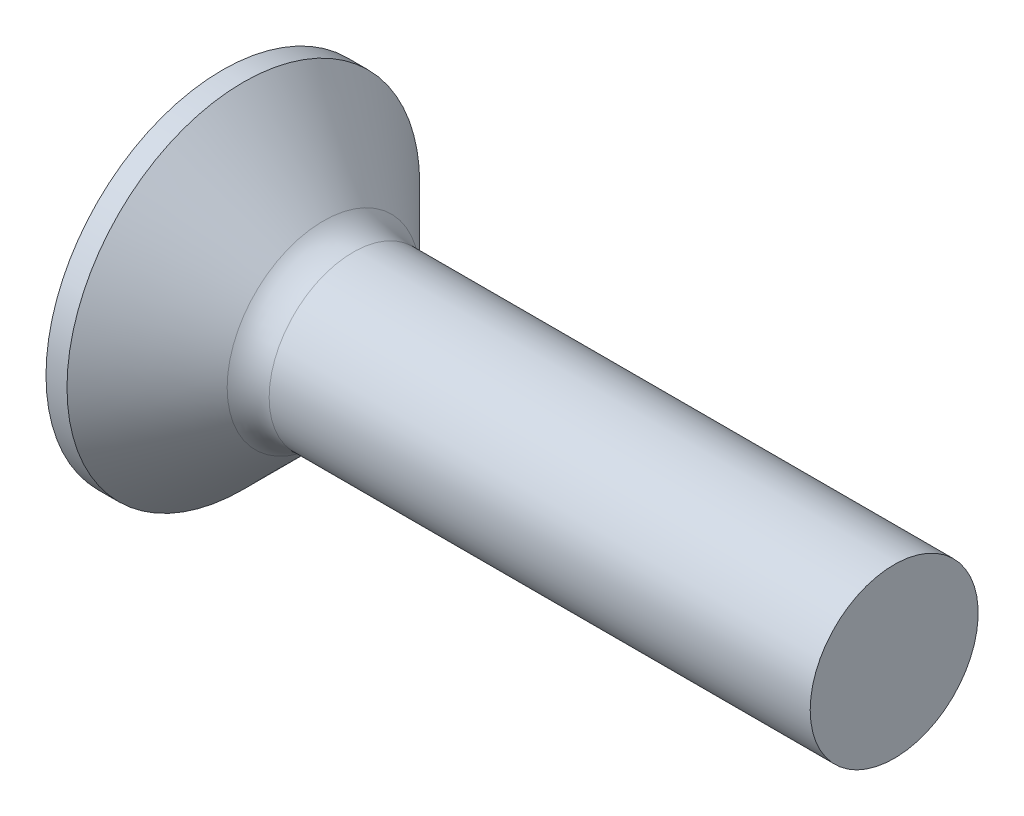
ISO-10303-21;
HEADER;
FILE_DESCRIPTION(('STEP AP214'),'2;1');
FILE_NAME('part.step','',(''),(''),'','','');
FILE_SCHEMA(('AUTOMOTIVE_DESIGN { 1 0 10303 214 1 1 1 1 }'));
ENDSEC;
DATA;
#1=APPLICATION_CONTEXT('core data for automotive mechanical design processes');
#2=APPLICATION_PROTOCOL_DEFINITION('international standard','automotive_design',2000,#1);
#3=PRODUCT_CONTEXT('',#1,'mechanical');
#4=PRODUCT('Part','Part','',(#3));
#5=PRODUCT_RELATED_PRODUCT_CATEGORY('part','',(#4));
#6=PRODUCT_DEFINITION_FORMATION('','',#4);
#7=PRODUCT_DEFINITION_CONTEXT('part definition',#1,'design');
#8=PRODUCT_DEFINITION('design','',#6,#7);
#9=PRODUCT_DEFINITION_SHAPE('','',#8);
#10=(LENGTH_UNIT() NAMED_UNIT(*) SI_UNIT(.MILLI.,.METRE.));
#11=(NAMED_UNIT(*) PLANE_ANGLE_UNIT() SI_UNIT($,.RADIAN.));
#12=(NAMED_UNIT(*) SI_UNIT($,.STERADIAN.) SOLID_ANGLE_UNIT());
#13=UNCERTAINTY_MEASURE_WITH_UNIT(LENGTH_MEASURE(1.E-05),#10,'distance_accuracy_value','');
#14=(GEOMETRIC_REPRESENTATION_CONTEXT(3) GLOBAL_UNCERTAINTY_ASSIGNED_CONTEXT((#13)) GLOBAL_UNIT_ASSIGNED_CONTEXT((#10,
#11,#12)) REPRESENTATION_CONTEXT('',''));
#15=CARTESIAN_POINT('',(0.,0.,0.));
#16=DIRECTION('',(0.,0.,1.));
#17=DIRECTION('',(1.,0.,0.));
#18=AXIS2_PLACEMENT_3D('',#15,#16,#17);
#19=CARTESIAN_POINT('',(0.,0.,0.));
#20=DIRECTION('',(-1.,0.,0.));
#21=DIRECTION('',(0.,0.,1.));
#22=AXIS2_PLACEMENT_3D('',#19,#20,#21);
#23=PLANE('',#22);
#24=CARTESIAN_POINT('',(0.,0.,0.));
#25=DIRECTION('',(-1.,0.,0.));
#26=DIRECTION('',(0.,0.,1.));
#27=AXIS2_PLACEMENT_3D('',#24,#25,#26);
#28=CIRCLE('',#27,4.2);
#29=CARTESIAN_POINT('',(0.,0.,4.2));
#30=VERTEX_POINT('',#29);
#31=EDGE_CURVE('E362',#30,#30,#28,.T.);
#32=ORIENTED_EDGE('',*,*,#31,.T.);
#33=EDGE_LOOP('',(#32));
#34=FACE_BOUND('',#33,.T.);
#35=DIRECTION('',(0.,0.,-1.));
#36=VECTOR('',#35,1.);
#37=CARTESIAN_POINT('',(0.,-0.515000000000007,2.2));
#38=LINE('',#37,#36);
#39=CARTESIAN_POINT('',(0.,-0.515000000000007,2.2));
#40=VERTEX_POINT('',#39);
#41=CARTESIAN_POINT('',(0.,-0.515000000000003,0.887981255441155));
#42=VERTEX_POINT('',#41);
#43=EDGE_CURVE('E300',#40,#42,#38,.T.);
#44=ORIENTED_EDGE('',*,*,#43,.T.);
#45=CARTESIAN_POINT('',(0.,0.,0.));
#46=DIRECTION('',(-1.,0.,0.));
#47=DIRECTION('',(0.,0.,1.));
#48=AXIS2_PLACEMENT_3D('',#45,#46,#47);
#49=CIRCLE('',#48,1.02651629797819);
#50=CARTESIAN_POINT('',(0.,-0.887981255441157,0.515));
#51=VERTEX_POINT('',#50);
#52=EDGE_CURVE('E391',#51,#42,#49,.T.);
#53=ORIENTED_EDGE('',*,*,#52,.F.);
#54=DIRECTION('',(0.,-1.,0.));
#55=VECTOR('',#54,1.);
#56=CARTESIAN_POINT('',(0.,2.2,0.515));
#57=LINE('',#56,#55);
#58=CARTESIAN_POINT('',(0.,-2.2,0.515));
#59=VERTEX_POINT('',#58);
#60=EDGE_CURVE('E326',#51,#59,#57,.T.);
#61=ORIENTED_EDGE('',*,*,#60,.T.);
#62=DIRECTION('',(0.,0.,-1.));
#63=VECTOR('',#62,1.);
#64=CARTESIAN_POINT('',(0.,-2.2,0.515));
#65=LINE('',#64,#63);
#66=CARTESIAN_POINT('',(0.,-2.2,-0.515));
#67=VERTEX_POINT('',#66);
#68=EDGE_CURVE('E331',#59,#67,#65,.T.);
#69=ORIENTED_EDGE('',*,*,#68,.T.);
#70=DIRECTION('',(0.,1.,0.));
#71=VECTOR('',#70,1.);
#72=CARTESIAN_POINT('',(0.,-2.2,-0.515));
#73=LINE('',#72,#71);
#74=CARTESIAN_POINT('',(0.,-0.887981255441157,-0.515));
#75=VERTEX_POINT('',#74);
#76=EDGE_CURVE('E327',#67,#75,#73,.T.);
#77=ORIENTED_EDGE('',*,*,#76,.T.);
#78=CARTESIAN_POINT('',(0.,-0.514999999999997,-0.887981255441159));
#79=VERTEX_POINT('',#78);
#80=EDGE_CURVE('E398',#79,#75,#49,.T.);
#81=ORIENTED_EDGE('',*,*,#80,.F.);
#82=CARTESIAN_POINT('',(0.,-0.514999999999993,-2.2));
#83=VERTEX_POINT('',#82);
#84=EDGE_CURVE('E298',#79,#83,#38,.T.);
#85=ORIENTED_EDGE('',*,*,#84,.T.);
#86=DIRECTION('',(0.,1.,0.));
#87=VECTOR('',#86,1.);
#88=CARTESIAN_POINT('',(0.,-0.514999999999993,-2.2));
#89=LINE('',#88,#87);
#90=CARTESIAN_POINT('',(0.,0.515000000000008,-2.2));
#91=VERTEX_POINT('',#90);
#92=EDGE_CURVE('E280',#83,#91,#89,.T.);
#93=ORIENTED_EDGE('',*,*,#92,.T.);
#94=DIRECTION('',(0.,0.,1.));
#95=VECTOR('',#94,1.);
#96=CARTESIAN_POINT('',(0.,0.515000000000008,-2.2));
#97=LINE('',#96,#95);
#98=CARTESIAN_POINT('',(0.,0.515000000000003,-0.887981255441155));
#99=VERTEX_POINT('',#98);
#100=EDGE_CURVE('E290',#91,#99,#97,.T.);
#101=ORIENTED_EDGE('',*,*,#100,.T.);
#102=CARTESIAN_POINT('',(0.,0.887981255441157,-0.515));
#103=VERTEX_POINT('',#102);
#104=EDGE_CURVE('E394',#103,#99,#49,.T.);
#105=ORIENTED_EDGE('',*,*,#104,.F.);
#106=CARTESIAN_POINT('',(0.,2.2,-0.515));
#107=VERTEX_POINT('',#106);
#108=EDGE_CURVE('E337',#103,#107,#73,.T.);
#109=ORIENTED_EDGE('',*,*,#108,.T.);
#110=DIRECTION('',(0.,0.,1.));
#111=VECTOR('',#110,1.);
#112=CARTESIAN_POINT('',(0.,2.2,-0.515));
#113=LINE('',#112,#111);
#114=CARTESIAN_POINT('',(0.,2.2,0.515));
#115=VERTEX_POINT('',#114);
#116=EDGE_CURVE('E323',#107,#115,#113,.T.);
#117=ORIENTED_EDGE('',*,*,#116,.T.);
#118=CARTESIAN_POINT('',(0.,0.887981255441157,0.515));
#119=VERTEX_POINT('',#118);
#120=EDGE_CURVE('E328',#115,#119,#57,.T.);
#121=ORIENTED_EDGE('',*,*,#120,.T.);
#122=CARTESIAN_POINT('',(0.,0.514999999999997,0.887981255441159));
#123=VERTEX_POINT('',#122);
#124=EDGE_CURVE('E393',#123,#119,#49,.T.);
#125=ORIENTED_EDGE('',*,*,#124,.F.);
#126=CARTESIAN_POINT('',(0.,0.514999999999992,2.2));
#127=VERTEX_POINT('',#126);
#128=EDGE_CURVE('E293',#123,#127,#97,.T.);
#129=ORIENTED_EDGE('',*,*,#128,.T.);
#130=DIRECTION('',(0.,-1.,0.));
#131=VECTOR('',#130,1.);
#132=CARTESIAN_POINT('',(0.,0.514999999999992,2.2));
#133=LINE('',#132,#131);
#134=EDGE_CURVE('E292',#127,#40,#133,.T.);
#135=ORIENTED_EDGE('',*,*,#134,.T.);
#136=EDGE_LOOP('',(#44,#53,#61,#69,#77,#81,#85,#93,#101,#105,#109,#117,#121,#125,#129,#135));
#137=FACE_BOUND('',#136,.T.);
#138=ADVANCED_FACE('F30',(#34,#137),#23,.T.);
#139=CARTESIAN_POINT('',(2.51,-0.948560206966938,0.515));
#140=DIRECTION('',(0.,0.,-1.));
#141=DIRECTION('',(0.,1.,0.));
#142=AXIS2_PLACEMENT_3D('',#139,#140,#141);
#143=PLANE('',#142);
#144=ORIENTED_EDGE('',*,*,#60,.F.);
#145=CARTESIAN_POINT('',(-1.54977564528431,-1.01130800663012,0.515));
#146=CARTESIAN_POINT('',(-1.23788517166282,-0.986826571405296,0.515));
#147=CARTESIAN_POINT('',(-0.926007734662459,-0.962176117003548,0.515));
#148=CARTESIAN_POINT('',(-0.302275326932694,-0.912414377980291,0.515));
#149=CARTESIAN_POINT('',(0.00957964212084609,-0.887303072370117,0.515));
#150=CARTESIAN_POINT('',(0.477326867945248,-0.849200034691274,0.515));
#151=CARTESIAN_POINT('',(0.63323687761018,-0.836426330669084,0.515));
#152=CARTESIAN_POINT('',(0.945041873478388,-0.810710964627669,0.515));
#153=CARTESIAN_POINT('',(1.10093685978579,-0.797769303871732,0.515));
#154=CARTESIAN_POINT('',(1.41270333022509,-0.771692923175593,0.515));
#155=CARTESIAN_POINT('',(1.56857481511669,-0.758558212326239,0.515));
#156=CARTESIAN_POINT('',(1.8803026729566,-0.732062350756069,0.515));
#157=CARTESIAN_POINT('',(2.03615904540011,-0.71870119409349,0.515));
#158=CARTESIAN_POINT('',(2.39015155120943,-0.688049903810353,0.515));
#159=CARTESIAN_POINT('',(2.58828059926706,-0.670677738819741,0.515));
#160=CARTESIAN_POINT('',(2.98448796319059,-0.635393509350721,0.515));
#161=CARTESIAN_POINT('',(3.18256627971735,-0.617481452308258,0.515));
#162=CARTESIAN_POINT('',(3.57863215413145,-0.580963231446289,0.515));
#163=CARTESIAN_POINT('',(3.77661972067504,-0.562357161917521,0.515));
#164=CARTESIAN_POINT('',(4.17251625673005,-0.524212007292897,0.515));
#165=CARTESIAN_POINT('',(4.37042522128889,-0.504672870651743,0.515));
#166=CARTESIAN_POINT('',(4.76621979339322,-0.464285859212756,0.515));
#167=CARTESIAN_POINT('',(4.96410533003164,-0.443437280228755,0.515));
#168=CARTESIAN_POINT('',(5.26075347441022,-0.410686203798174,0.515));
#169=CARTESIAN_POINT('',(5.35959766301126,-0.399523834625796,0.515));
#170=CARTESIAN_POINT('',(5.5572169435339,-0.376561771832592,0.515));
#171=CARTESIAN_POINT('',(5.65599203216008,-0.364762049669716,0.515));
#172=CARTESIAN_POINT('',(5.85350341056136,-0.340311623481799,0.515));
#173=CARTESIAN_POINT('',(5.95223963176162,-0.327660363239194,0.515));
#174=CARTESIAN_POINT('',(6.14954565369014,-0.301187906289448,0.515));
#175=CARTESIAN_POINT('',(6.24811547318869,-0.287366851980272,0.515));
#176=CARTESIAN_POINT('',(6.39580251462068,-0.265292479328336,0.515));
#177=CARTESIAN_POINT('',(6.44501926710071,-0.257707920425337,0.515));
#178=CARTESIAN_POINT('',(6.54335575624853,-0.241951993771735,0.515));
#179=CARTESIAN_POINT('',(6.5924754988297,-0.233780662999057,0.515));
#180=CARTESIAN_POINT('',(6.69060451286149,-0.216664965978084,0.515));
#181=CARTESIAN_POINT('',(6.73961372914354,-0.207720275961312,0.515));
#182=CARTESIAN_POINT('',(6.83741121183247,-0.188649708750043,0.515));
#183=CARTESIAN_POINT('',(6.88619942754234,-0.178523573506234,0.515));
#184=CARTESIAN_POINT('',(6.9348215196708,-0.167602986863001,0.515));
#185=B_SPLINE_CURVE_WITH_KNOTS('',3,(#145,#146,#147,#148,#149,#150,#151,#152,#153,#154,#155,
#156,#157,#158,#159,#160,#161,#162,#163,#164,#165,#166,#167,#168,#169,#170,#171,#172,#173,#174,
#175,#176,#177,#178,#179,#180,#181,#182,#183,#184),.UNSPECIFIED.,.F.,.F.,(4,2,2,2,2,2,2,2,2,2,2,
2,2,2,2,2,2,2,2,4),(0.,0.938549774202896,1.87714239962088,2.34643954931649,2.81573317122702,
3.2850047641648,3.75428868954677,4.35095567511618,4.9476144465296,5.54419244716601,
6.14080344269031,6.73773807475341,7.03615402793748,7.33458335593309,7.63320954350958,
7.93179943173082,8.08118979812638,8.23057075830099,8.38001456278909,8.52949106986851),.UNSPECIFIED.);
#186=CARTESIAN_POINT('',(2.51,-0.677477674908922,0.515));
#187=VERTEX_POINT('',#186);
#188=EDGE_CURVE('E406',#51,#187,#185,.T.);
#189=ORIENTED_EDGE('',*,*,#188,.T.);
#190=DIRECTION('',(0.,-1.,0.));
#191=VECTOR('',#190,1.);
#192=CARTESIAN_POINT('',(2.51,0.948560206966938,0.515));
#193=LINE('',#192,#191);
#194=CARTESIAN_POINT('',(2.51,-0.948560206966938,0.515));
#195=VERTEX_POINT('',#194);
#196=EDGE_CURVE('E351',#187,#195,#193,.T.);
#197=ORIENTED_EDGE('',*,*,#196,.T.);
#198=DIRECTION('',(0.89493436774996,0.446197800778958,0.));
#199=VECTOR('',#198,1.);
#200=CARTESIAN_POINT('',(0.,-2.2,0.515));
#201=LINE('',#200,#199);
#202=EDGE_CURVE('E338',#59,#195,#201,.T.);
#203=ORIENTED_EDGE('',*,*,#202,.F.);
#204=EDGE_LOOP('',(#144,#189,#197,#203));
#205=FACE_BOUND('',#204,.T.);
#206=ADVANCED_FACE('F162',(#205),#143,.T.);
#207=CARTESIAN_POINT('',(2.51,0.948560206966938,0.515));
#208=VERTEX_POINT('',#207);
#209=CARTESIAN_POINT('',(2.51,0.677477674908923,0.514999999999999));
#210=VERTEX_POINT('',#209);
#211=EDGE_CURVE('E352',#208,#210,#193,.T.);
#212=ORIENTED_EDGE('',*,*,#211,.T.);
#213=CARTESIAN_POINT('',(-1.54977564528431,1.01130800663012,0.515));
#214=CARTESIAN_POINT('',(-1.23788517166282,0.986826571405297,0.515));
#215=CARTESIAN_POINT('',(-0.926007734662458,0.962176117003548,0.515));
#216=CARTESIAN_POINT('',(-0.302275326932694,0.912414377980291,0.515));
#217=CARTESIAN_POINT('',(0.00957964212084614,0.887303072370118,0.515));
#218=CARTESIAN_POINT('',(0.477326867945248,0.849200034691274,0.515));
#219=CARTESIAN_POINT('',(0.63323687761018,0.836426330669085,0.515));
#220=CARTESIAN_POINT('',(0.945041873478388,0.810710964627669,0.515));
#221=CARTESIAN_POINT('',(1.10093685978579,0.797769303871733,0.515));
#222=CARTESIAN_POINT('',(1.41270333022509,0.771692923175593,0.515));
#223=CARTESIAN_POINT('',(1.56857481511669,0.758558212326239,0.515));
#224=CARTESIAN_POINT('',(1.8803026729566,0.732062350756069,0.515));
#225=CARTESIAN_POINT('',(2.03615904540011,0.71870119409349,0.515));
#226=CARTESIAN_POINT('',(2.39015155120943,0.688049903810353,0.515));
#227=CARTESIAN_POINT('',(2.58828059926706,0.670677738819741,0.515));
#228=CARTESIAN_POINT('',(2.98448796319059,0.635393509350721,0.515));
#229=CARTESIAN_POINT('',(3.18256627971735,0.617481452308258,0.515));
#230=CARTESIAN_POINT('',(3.57863215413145,0.580963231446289,0.515));
#231=CARTESIAN_POINT('',(3.77661972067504,0.562357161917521,0.515));
#232=CARTESIAN_POINT('',(4.17251625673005,0.524212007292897,0.515));
#233=CARTESIAN_POINT('',(4.37042522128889,0.504672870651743,0.515));
#234=CARTESIAN_POINT('',(4.76621979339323,0.464285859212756,0.515));
#235=CARTESIAN_POINT('',(4.96410533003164,0.443437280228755,0.515));
#236=CARTESIAN_POINT('',(5.26075347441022,0.410686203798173,0.515));
#237=CARTESIAN_POINT('',(5.35959766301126,0.399523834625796,0.515));
#238=CARTESIAN_POINT('',(5.55721694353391,0.376561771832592,0.515));
#239=CARTESIAN_POINT('',(5.65599203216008,0.364762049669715,0.515));
#240=CARTESIAN_POINT('',(5.85350341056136,0.340311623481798,0.515));
#241=CARTESIAN_POINT('',(5.95223963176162,0.327660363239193,0.515));
#242=CARTESIAN_POINT('',(6.14954565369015,0.301187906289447,0.515));
#243=CARTESIAN_POINT('',(6.24811547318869,0.287366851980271,0.515));
#244=CARTESIAN_POINT('',(6.39580251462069,0.265292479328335,0.515));
#245=CARTESIAN_POINT('',(6.44501926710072,0.257707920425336,0.515));
#246=CARTESIAN_POINT('',(6.54335575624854,0.241951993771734,0.515));
#247=CARTESIAN_POINT('',(6.59247549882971,0.233780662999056,0.515));
#248=CARTESIAN_POINT('',(6.6906045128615,0.216664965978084,0.515));
#249=CARTESIAN_POINT('',(6.73961372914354,0.207720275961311,0.515));
#250=CARTESIAN_POINT('',(6.83741121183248,0.188649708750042,0.515));
#251=CARTESIAN_POINT('',(6.88619942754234,0.178523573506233,0.515));
#252=CARTESIAN_POINT('',(6.9348215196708,0.167602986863,0.515));
#253=B_SPLINE_CURVE_WITH_KNOTS('',3,(#213,#214,#215,#216,#217,#218,#219,#220,#221,#222,#223,
#224,#225,#226,#227,#228,#229,#230,#231,#232,#233,#234,#235,#236,#237,#238,#239,#240,#241,#242,
#243,#244,#245,#246,#247,#248,#249,#250,#251,#252),.UNSPECIFIED.,.F.,.F.,(4,2,2,2,2,2,2,2,2,2,2,
2,2,2,2,2,2,2,2,4),(0.,0.938549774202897,1.87714239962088,2.34643954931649,2.81573317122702,
3.2850047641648,3.75428868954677,4.35095567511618,4.9476144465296,5.54419244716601,
6.14080344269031,6.73773807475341,7.03615402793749,7.33458335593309,7.63320954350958,
7.93179943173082,8.08118979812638,8.23057075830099,8.3800145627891,8.52949106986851),.UNSPECIFIED.);
#254=EDGE_CURVE('E222',#210,#119,#253,.F.);
#255=ORIENTED_EDGE('',*,*,#254,.T.);
#256=ORIENTED_EDGE('',*,*,#120,.F.);
#257=DIRECTION('',(0.89493436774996,-0.446197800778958,0.));
#258=VECTOR('',#257,1.);
#259=CARTESIAN_POINT('',(0.,2.2,0.515));
#260=LINE('',#259,#258);
#261=EDGE_CURVE('E58',#115,#208,#260,.T.);
#262=ORIENTED_EDGE('',*,*,#261,.T.);
#263=EDGE_LOOP('',(#212,#255,#256,#262));
#264=FACE_BOUND('',#263,.T.);
#265=ADVANCED_FACE('F167',(#264),#143,.T.);
#266=CARTESIAN_POINT('',(2.51,0.948560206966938,-0.515));
#267=DIRECTION('',(0.,0.,1.));
#268=DIRECTION('',(1.,0.,0.));
#269=AXIS2_PLACEMENT_3D('',#266,#267,#268);
#270=PLANE('',#269);
#271=DIRECTION('',(0.,1.,0.));
#272=VECTOR('',#271,1.);
#273=CARTESIAN_POINT('',(2.51,-0.948560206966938,-0.515));
#274=LINE('',#273,#272);
#275=CARTESIAN_POINT('',(2.51,-0.948560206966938,-0.515));
#276=VERTEX_POINT('',#275);
#277=CARTESIAN_POINT('',(2.51,-0.677477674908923,-0.514999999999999));
#278=VERTEX_POINT('',#277);
#279=EDGE_CURVE('E302',#276,#278,#274,.T.);
#280=ORIENTED_EDGE('',*,*,#279,.T.);
#281=CARTESIAN_POINT('',(-1.54977564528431,-1.01130800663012,-0.515));
#282=CARTESIAN_POINT('',(-1.23788517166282,-0.986826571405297,-0.515));
#283=CARTESIAN_POINT('',(-0.926007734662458,-0.962176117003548,-0.515));
#284=CARTESIAN_POINT('',(-0.302275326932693,-0.912414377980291,-0.515));
#285=CARTESIAN_POINT('',(0.00957964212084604,-0.887303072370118,-0.515));
#286=CARTESIAN_POINT('',(0.477326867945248,-0.849200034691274,-0.515));
#287=CARTESIAN_POINT('',(0.63323687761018,-0.836426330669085,-0.515));
#288=CARTESIAN_POINT('',(0.945041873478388,-0.810710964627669,-0.515));
#289=CARTESIAN_POINT('',(1.10093685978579,-0.797769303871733,-0.515));
#290=CARTESIAN_POINT('',(1.41270333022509,-0.771692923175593,-0.515));
#291=CARTESIAN_POINT('',(1.56857481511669,-0.758558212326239,-0.515));
#292=CARTESIAN_POINT('',(1.8803026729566,-0.732062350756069,-0.515));
#293=CARTESIAN_POINT('',(2.03615904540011,-0.71870119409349,-0.515));
#294=CARTESIAN_POINT('',(2.39015155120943,-0.688049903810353,-0.515));
#295=CARTESIAN_POINT('',(2.58828059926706,-0.670677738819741,-0.515));
#296=CARTESIAN_POINT('',(2.98448796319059,-0.635393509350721,-0.515));
#297=CARTESIAN_POINT('',(3.18256627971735,-0.617481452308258,-0.515));
#298=CARTESIAN_POINT('',(3.57863215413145,-0.580963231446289,-0.515));
#299=CARTESIAN_POINT('',(3.77661972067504,-0.562357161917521,-0.515));
#300=CARTESIAN_POINT('',(4.17251625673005,-0.524212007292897,-0.515));
#301=CARTESIAN_POINT('',(4.37042522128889,-0.504672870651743,-0.515));
#302=CARTESIAN_POINT('',(4.76621979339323,-0.464285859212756,-0.515));
#303=CARTESIAN_POINT('',(4.96410533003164,-0.443437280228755,-0.515));
#304=CARTESIAN_POINT('',(5.26075347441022,-0.410686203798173,-0.515));
#305=CARTESIAN_POINT('',(5.35959766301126,-0.399523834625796,-0.515));
#306=CARTESIAN_POINT('',(5.55721694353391,-0.376561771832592,-0.515));
#307=CARTESIAN_POINT('',(5.65599203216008,-0.364762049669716,-0.515));
#308=CARTESIAN_POINT('',(5.85350341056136,-0.340311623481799,-0.515));
#309=CARTESIAN_POINT('',(5.95223963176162,-0.327660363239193,-0.515));
#310=CARTESIAN_POINT('',(6.14954565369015,-0.301187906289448,-0.515));
#311=CARTESIAN_POINT('',(6.24811547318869,-0.287366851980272,-0.515));
#312=CARTESIAN_POINT('',(6.39580251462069,-0.265292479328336,-0.515));
#313=CARTESIAN_POINT('',(6.44501926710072,-0.257707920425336,-0.515));
#314=CARTESIAN_POINT('',(6.54335575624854,-0.241951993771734,-0.515));
#315=CARTESIAN_POINT('',(6.59247549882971,-0.233780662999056,-0.515));
#316=CARTESIAN_POINT('',(6.6906045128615,-0.216664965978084,-0.515));
#317=CARTESIAN_POINT('',(6.73961372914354,-0.207720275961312,-0.515));
#318=CARTESIAN_POINT('',(6.83741121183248,-0.188649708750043,-0.515));
#319=CARTESIAN_POINT('',(6.88619942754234,-0.178523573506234,-0.515));
#320=CARTESIAN_POINT('',(6.9348215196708,-0.167602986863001,-0.515));
#321=B_SPLINE_CURVE_WITH_KNOTS('',3,(#281,#282,#283,#284,#285,#286,#287,#288,#289,#290,#291,
#292,#293,#294,#295,#296,#297,#298,#299,#300,#301,#302,#303,#304,#305,#306,#307,#308,#309,#310,
#311,#312,#313,#314,#315,#316,#317,#318,#319,#320),.UNSPECIFIED.,.F.,.F.,(4,2,2,2,2,2,2,2,2,2,2,
2,2,2,2,2,2,2,2,4),(0.,0.938549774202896,1.87714239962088,2.34643954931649,2.81573317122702,
3.2850047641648,3.75428868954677,4.35095567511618,4.9476144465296,5.54419244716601,
6.14080344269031,6.73773807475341,7.03615402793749,7.33458335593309,7.63320954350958,
7.93179943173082,8.08118979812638,8.23057075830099,8.3800145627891,8.52949106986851),.UNSPECIFIED.);
#322=EDGE_CURVE('E216',#278,#75,#321,.F.);
#323=ORIENTED_EDGE('',*,*,#322,.T.);
#324=ORIENTED_EDGE('',*,*,#76,.F.);
#325=DIRECTION('',(0.89493436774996,0.446197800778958,0.));
#326=VECTOR('',#325,1.);
#327=CARTESIAN_POINT('',(0.,-2.2,-0.515));
#328=LINE('',#327,#326);
#329=EDGE_CURVE('E341',#67,#276,#328,.T.);
#330=ORIENTED_EDGE('',*,*,#329,.T.);
#331=EDGE_LOOP('',(#280,#323,#324,#330));
#332=FACE_BOUND('',#331,.T.);
#333=ADVANCED_FACE('F202',(#332),#270,.T.);
#334=ORIENTED_EDGE('',*,*,#108,.F.);
#335=CARTESIAN_POINT('',(-1.54977564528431,1.01130800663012,-0.515));
#336=CARTESIAN_POINT('',(-1.23788517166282,0.986826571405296,-0.515));
#337=CARTESIAN_POINT('',(-0.926007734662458,0.962176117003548,-0.515));
#338=CARTESIAN_POINT('',(-0.302275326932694,0.912414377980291,-0.515));
#339=CARTESIAN_POINT('',(0.00957964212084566,0.887303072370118,-0.515));
#340=CARTESIAN_POINT('',(0.477326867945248,0.849200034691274,-0.515));
#341=CARTESIAN_POINT('',(0.63323687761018,0.836426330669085,-0.515));
#342=CARTESIAN_POINT('',(0.945041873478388,0.810710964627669,-0.515));
#343=CARTESIAN_POINT('',(1.10093685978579,0.797769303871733,-0.515));
#344=CARTESIAN_POINT('',(1.41270333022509,0.771692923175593,-0.515));
#345=CARTESIAN_POINT('',(1.56857481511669,0.758558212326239,-0.515));
#346=CARTESIAN_POINT('',(1.8803026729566,0.732062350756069,-0.515));
#347=CARTESIAN_POINT('',(2.03615904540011,0.71870119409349,-0.515));
#348=CARTESIAN_POINT('',(2.39015155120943,0.688049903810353,-0.515));
#349=CARTESIAN_POINT('',(2.58828059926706,0.670677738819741,-0.515));
#350=CARTESIAN_POINT('',(2.98448796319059,0.635393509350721,-0.515));
#351=CARTESIAN_POINT('',(3.18256627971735,0.617481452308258,-0.515));
#352=CARTESIAN_POINT('',(3.57863215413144,0.580963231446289,-0.515));
#353=CARTESIAN_POINT('',(3.77661972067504,0.562357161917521,-0.515));
#354=CARTESIAN_POINT('',(4.17251625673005,0.524212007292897,-0.515));
#355=CARTESIAN_POINT('',(4.37042522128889,0.504672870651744,-0.515));
#356=CARTESIAN_POINT('',(4.76621979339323,0.464285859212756,-0.515));
#357=CARTESIAN_POINT('',(4.96410533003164,0.443437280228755,-0.515));
#358=CARTESIAN_POINT('',(5.26075347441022,0.410686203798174,-0.515));
#359=CARTESIAN_POINT('',(5.35959766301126,0.399523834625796,-0.515));
#360=CARTESIAN_POINT('',(5.5572169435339,0.376561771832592,-0.515));
#361=CARTESIAN_POINT('',(5.65599203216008,0.364762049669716,-0.515));
#362=CARTESIAN_POINT('',(5.85350341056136,0.340311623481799,-0.515));
#363=CARTESIAN_POINT('',(5.95223963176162,0.327660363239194,-0.515));
#364=CARTESIAN_POINT('',(6.14954565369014,0.301187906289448,-0.515));
#365=CARTESIAN_POINT('',(6.24811547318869,0.287366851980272,-0.515));
#366=CARTESIAN_POINT('',(6.39580251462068,0.265292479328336,-0.515));
#367=CARTESIAN_POINT('',(6.44501926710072,0.257707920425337,-0.515));
#368=CARTESIAN_POINT('',(6.54335575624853,0.241951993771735,-0.515));
#369=CARTESIAN_POINT('',(6.5924754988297,0.233780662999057,-0.515));
#370=CARTESIAN_POINT('',(6.69060451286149,0.216664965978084,-0.515));
#371=CARTESIAN_POINT('',(6.73961372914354,0.207720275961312,-0.515));
#372=CARTESIAN_POINT('',(6.83741121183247,0.188649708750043,-0.515));
#373=CARTESIAN_POINT('',(6.88619942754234,0.178523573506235,-0.515));
#374=CARTESIAN_POINT('',(6.9348215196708,0.167602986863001,-0.515));
#375=B_SPLINE_CURVE_WITH_KNOTS('',3,(#335,#336,#337,#338,#339,#340,#341,#342,#343,#344,#345,
#346,#347,#348,#349,#350,#351,#352,#353,#354,#355,#356,#357,#358,#359,#360,#361,#362,#363,#364,
#365,#366,#367,#368,#369,#370,#371,#372,#373,#374),.UNSPECIFIED.,.F.,.F.,(4,2,2,2,2,2,2,2,2,2,2,
2,2,2,2,2,2,2,2,4),(0.,0.938549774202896,1.87714239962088,2.34643954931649,2.81573317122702,
3.2850047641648,3.75428868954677,4.35095567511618,4.9476144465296,5.54419244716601,
6.14080344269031,6.73773807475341,7.03615402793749,7.33458335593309,7.63320954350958,
7.93179943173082,8.08118979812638,8.23057075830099,8.38001456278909,8.5294910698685),.UNSPECIFIED.);
#376=CARTESIAN_POINT('',(2.51,0.677477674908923,-0.514999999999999));
#377=VERTEX_POINT('',#376);
#378=EDGE_CURVE('E210',#103,#377,#375,.T.);
#379=ORIENTED_EDGE('',*,*,#378,.T.);
#380=CARTESIAN_POINT('',(2.51,0.948560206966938,-0.515));
#381=VERTEX_POINT('',#380);
#382=EDGE_CURVE('E299',#377,#381,#274,.T.);
#383=ORIENTED_EDGE('',*,*,#382,.T.);
#384=DIRECTION('',(0.89493436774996,-0.446197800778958,0.));
#385=VECTOR('',#384,1.);
#386=CARTESIAN_POINT('',(0.,2.2,-0.515));
#387=LINE('',#386,#385);
#388=EDGE_CURVE('E345',#107,#381,#387,.T.);
#389=ORIENTED_EDGE('',*,*,#388,.F.);
#390=EDGE_LOOP('',(#334,#379,#383,#389));
#391=FACE_BOUND('',#390,.T.);
#392=ADVANCED_FACE('F194',(#391),#270,.T.);
#393=CARTESIAN_POINT('',(2.51,0.948560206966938,-0.515));
#394=DIRECTION('',(1.,0.,0.));
#395=DIRECTION('',(0.,0.,-1.));
#396=AXIS2_PLACEMENT_3D('',#393,#394,#395);
#397=PLANE('',#396);
#398=CARTESIAN_POINT('',(2.51,0.,0.));
#399=DIRECTION('',(-1.,0.,0.));
#400=DIRECTION('',(0.,0.,1.));
#401=AXIS2_PLACEMENT_3D('',#398,#399,#400);
#402=CIRCLE('',#401,0.851);
#403=EDGE_CURVE('E382',#278,#187,#402,.T.);
#404=ORIENTED_EDGE('',*,*,#403,.F.);
#405=ORIENTED_EDGE('',*,*,#279,.F.);
#406=DIRECTION('',(0.,0.,-1.));
#407=VECTOR('',#406,1.);
#408=CARTESIAN_POINT('',(2.51,-0.948560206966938,0.515));
#409=LINE('',#408,#407);
#410=EDGE_CURVE('E348',#195,#276,#409,.T.);
#411=ORIENTED_EDGE('',*,*,#410,.F.);
#412=ORIENTED_EDGE('',*,*,#196,.F.);
#413=EDGE_LOOP('',(#404,#405,#411,#412));
#414=FACE_BOUND('',#413,.T.);
#415=ADVANCED_FACE('F190',(#414),#397,.F.);
#416=CARTESIAN_POINT('',(2.51,-0.515000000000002,0.67747767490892));
#417=VERTEX_POINT('',#416);
#418=CARTESIAN_POINT('',(2.51,0.514999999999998,0.677477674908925));
#419=VERTEX_POINT('',#418);
#420=EDGE_CURVE('E390',#417,#419,#402,.T.);
#421=ORIENTED_EDGE('',*,*,#420,.F.);
#422=DIRECTION('',(0.,0.,-1.));
#423=VECTOR('',#422,1.);
#424=CARTESIAN_POINT('',(2.51,-0.515000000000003,0.948560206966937));
#425=LINE('',#424,#423);
#426=CARTESIAN_POINT('',(2.51,-0.515000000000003,0.948560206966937));
#427=VERTEX_POINT('',#426);
#428=EDGE_CURVE('E317',#427,#417,#425,.T.);
#429=ORIENTED_EDGE('',*,*,#428,.F.);
#430=DIRECTION('',(0.,-1.,0.));
#431=VECTOR('',#430,1.);
#432=CARTESIAN_POINT('',(2.51,0.514999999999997,0.94856020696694));
#433=LINE('',#432,#431);
#434=CARTESIAN_POINT('',(2.51,0.514999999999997,0.94856020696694));
#435=VERTEX_POINT('',#434);
#436=EDGE_CURVE('E312',#435,#427,#433,.T.);
#437=ORIENTED_EDGE('',*,*,#436,.F.);
#438=DIRECTION('',(0.,0.,1.));
#439=VECTOR('',#438,1.);
#440=CARTESIAN_POINT('',(2.51,0.515000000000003,-0.948560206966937));
#441=LINE('',#440,#439);
#442=EDGE_CURVE('E322',#419,#435,#441,.T.);
#443=ORIENTED_EDGE('',*,*,#442,.F.);
#444=EDGE_LOOP('',(#421,#429,#437,#443));
#445=FACE_BOUND('',#444,.T.);
#446=ADVANCED_FACE('F193',(#445),#397,.F.);
#447=EDGE_CURVE('E392',#210,#377,#402,.T.);
#448=ORIENTED_EDGE('',*,*,#447,.F.);
#449=ORIENTED_EDGE('',*,*,#211,.F.);
#450=DIRECTION('',(0.,0.,1.));
#451=VECTOR('',#450,1.);
#452=CARTESIAN_POINT('',(2.51,0.948560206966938,-0.515));
#453=LINE('',#452,#451);
#454=EDGE_CURVE('E349',#381,#208,#453,.T.);
#455=ORIENTED_EDGE('',*,*,#454,.F.);
#456=ORIENTED_EDGE('',*,*,#382,.F.);
#457=EDGE_LOOP('',(#448,#449,#455,#456));
#458=FACE_BOUND('',#457,.T.);
#459=ADVANCED_FACE('F422',(#458),#397,.F.);
#460=CARTESIAN_POINT('',(2.51,0.515000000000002,-0.67747767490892));
#461=VERTEX_POINT('',#460);
#462=CARTESIAN_POINT('',(2.51,-0.514999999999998,-0.677477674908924));
#463=VERTEX_POINT('',#462);
#464=EDGE_CURVE('E389',#461,#463,#402,.T.);
#465=ORIENTED_EDGE('',*,*,#464,.F.);
#466=CARTESIAN_POINT('',(2.51,0.515000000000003,-0.948560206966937));
#467=VERTEX_POINT('',#466);
#468=EDGE_CURVE('E316',#467,#461,#441,.T.);
#469=ORIENTED_EDGE('',*,*,#468,.F.);
#470=DIRECTION('',(0.,1.,0.));
#471=VECTOR('',#470,1.);
#472=CARTESIAN_POINT('',(2.51,-0.514999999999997,-0.94856020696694));
#473=LINE('',#472,#471);
#474=CARTESIAN_POINT('',(2.51,-0.514999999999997,-0.94856020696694));
#475=VERTEX_POINT('',#474);
#476=EDGE_CURVE('E283',#475,#467,#473,.T.);
#477=ORIENTED_EDGE('',*,*,#476,.F.);
#478=EDGE_CURVE('E315',#463,#475,#425,.T.);
#479=ORIENTED_EDGE('',*,*,#478,.F.);
#480=EDGE_LOOP('',(#465,#469,#477,#479));
#481=FACE_BOUND('',#480,.T.);
#482=ADVANCED_FACE('F196',(#481),#397,.F.);
#483=CARTESIAN_POINT('',(2.51,0.514999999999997,0.94856020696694));
#484=DIRECTION('',(0.,-1.,0.));
#485=DIRECTION('',(1.,0.,0.));
#486=AXIS2_PLACEMENT_3D('',#483,#484,#485);
#487=PLANE('',#486);
#488=ORIENTED_EDGE('',*,*,#468,.T.);
#489=CARTESIAN_POINT('',(-1.54977564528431,0.515000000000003,-1.01130800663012));
#490=CARTESIAN_POINT('',(-1.23788517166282,0.515000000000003,-0.986826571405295));
#491=CARTESIAN_POINT('',(-0.926007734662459,0.515000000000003,-0.962176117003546));
#492=CARTESIAN_POINT('',(-0.302275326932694,0.515000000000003,-0.912414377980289));
#493=CARTESIAN_POINT('',(0.0095796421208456,0.515000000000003,-0.887303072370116));
#494=CARTESIAN_POINT('',(0.477326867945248,0.515000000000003,-0.849200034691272));
#495=CARTESIAN_POINT('',(0.633236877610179,0.515000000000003,-0.836426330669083));
#496=CARTESIAN_POINT('',(0.945041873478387,0.515000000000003,-0.810710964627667));
#497=CARTESIAN_POINT('',(1.10093685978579,0.515000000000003,-0.797769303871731));
#498=CARTESIAN_POINT('',(1.41270333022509,0.515000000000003,-0.771692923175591));
#499=CARTESIAN_POINT('',(1.56857481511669,0.515000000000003,-0.758558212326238));
#500=CARTESIAN_POINT('',(1.8803026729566,0.515000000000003,-0.732062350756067));
#501=CARTESIAN_POINT('',(2.03615904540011,0.515000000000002,-0.718701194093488));
#502=CARTESIAN_POINT('',(2.39015155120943,0.515000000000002,-0.688049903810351));
#503=CARTESIAN_POINT('',(2.58828059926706,0.515000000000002,-0.670677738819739));
#504=CARTESIAN_POINT('',(2.98448796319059,0.515000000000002,-0.63539350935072));
#505=CARTESIAN_POINT('',(3.18256627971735,0.515000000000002,-0.617481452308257));
#506=CARTESIAN_POINT('',(3.57863215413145,0.515000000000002,-0.580963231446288));
#507=CARTESIAN_POINT('',(3.77661972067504,0.515000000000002,-0.562357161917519));
#508=CARTESIAN_POINT('',(4.17251625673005,0.515000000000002,-0.524212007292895));
#509=CARTESIAN_POINT('',(4.37042522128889,0.515000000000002,-0.504672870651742));
#510=CARTESIAN_POINT('',(4.76621979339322,0.515000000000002,-0.464285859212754));
#511=CARTESIAN_POINT('',(4.96410533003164,0.515000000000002,-0.443437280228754));
#512=CARTESIAN_POINT('',(5.26075347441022,0.515000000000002,-0.410686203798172));
#513=CARTESIAN_POINT('',(5.35959766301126,0.515000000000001,-0.399523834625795));
#514=CARTESIAN_POINT('',(5.5572169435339,0.515000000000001,-0.376561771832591));
#515=CARTESIAN_POINT('',(5.65599203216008,0.515000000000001,-0.364762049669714));
#516=CARTESIAN_POINT('',(5.85350341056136,0.515000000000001,-0.340311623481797));
#517=CARTESIAN_POINT('',(5.95223963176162,0.515000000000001,-0.327660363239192));
#518=CARTESIAN_POINT('',(6.14954565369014,0.515000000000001,-0.301187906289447));
#519=CARTESIAN_POINT('',(6.24811547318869,0.515000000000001,-0.28736685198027));
#520=CARTESIAN_POINT('',(6.39580251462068,0.515000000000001,-0.265292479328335));
#521=CARTESIAN_POINT('',(6.44501926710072,0.515000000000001,-0.257707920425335));
#522=CARTESIAN_POINT('',(6.54335575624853,0.515000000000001,-0.241951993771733));
#523=CARTESIAN_POINT('',(6.5924754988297,0.515000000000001,-0.233780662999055));
#524=CARTESIAN_POINT('',(6.69060451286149,0.515000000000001,-0.216664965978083));
#525=CARTESIAN_POINT('',(6.73961372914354,0.515000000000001,-0.20772027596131));
#526=CARTESIAN_POINT('',(6.83741121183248,0.515000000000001,-0.188649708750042));
#527=CARTESIAN_POINT('',(6.88619942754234,0.515000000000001,-0.178523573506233));
#528=CARTESIAN_POINT('',(6.9348215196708,0.515000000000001,-0.167602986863));
#529=B_SPLINE_CURVE_WITH_KNOTS('',3,(#489,#490,#491,#492,#493,#494,#495,#496,#497,#498,#499,
#500,#501,#502,#503,#504,#505,#506,#507,#508,#509,#510,#511,#512,#513,#514,#515,#516,#517,#518,
#519,#520,#521,#522,#523,#524,#525,#526,#527,#528),.UNSPECIFIED.,.F.,.F.,(4,2,2,2,2,2,2,2,2,2,2,
2,2,2,2,2,2,2,2,4),(0.,0.938549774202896,1.87714239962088,2.34643954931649,2.81573317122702,
3.2850047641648,3.75428868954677,4.35095567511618,4.9476144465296,5.54419244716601,
6.14080344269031,6.73773807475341,7.03615402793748,7.33458335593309,7.63320954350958,
7.93179943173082,8.08118979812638,8.23057075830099,8.38001456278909,8.52949106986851),.UNSPECIFIED.);
#530=EDGE_CURVE('E247',#461,#99,#529,.F.);
#531=ORIENTED_EDGE('',*,*,#530,.T.);
#532=ORIENTED_EDGE('',*,*,#100,.F.);
#533=DIRECTION('',(0.89493436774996,0.,0.446197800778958));
#534=VECTOR('',#533,1.);
#535=CARTESIAN_POINT('',(0.,0.515000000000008,-2.2));
#536=LINE('',#535,#534);
#537=EDGE_CURVE('E276',#91,#467,#536,.T.);
#538=ORIENTED_EDGE('',*,*,#537,.T.);
#539=EDGE_LOOP('',(#488,#531,#532,#538));
#540=FACE_BOUND('',#539,.T.);
#541=ADVANCED_FACE('F253',(#540),#487,.T.);
#542=CARTESIAN_POINT('',(2.51,-0.514999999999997,-0.94856020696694));
#543=DIRECTION('',(0.,1.,0.));
#544=DIRECTION('',(0.,0.,1.));
#545=AXIS2_PLACEMENT_3D('',#542,#543,#544);
#546=PLANE('',#545);
#547=ORIENTED_EDGE('',*,*,#84,.F.);
#548=CARTESIAN_POINT('',(-1.54977564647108,-0.514999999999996,-1.01130800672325));
#549=CARTESIAN_POINT('',(-1.23788517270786,-0.514999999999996,-0.986826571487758));
#550=CARTESIAN_POINT('',(-0.926007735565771,-0.514999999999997,-0.962176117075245));
#551=CARTESIAN_POINT('',(-0.302275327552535,-0.514999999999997,-0.912414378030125));
#552=CARTESIAN_POINT('',(0.00957964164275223,-0.514999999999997,-0.887303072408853));
#553=CARTESIAN_POINT('',(0.477326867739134,-0.514999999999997,-0.849200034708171));
#554=CARTESIAN_POINT('',(0.633236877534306,-0.514999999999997,-0.836426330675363));
#555=CARTESIAN_POINT('',(0.945041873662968,-0.514999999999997,-0.810710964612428));
#556=CARTESIAN_POINT('',(1.10093686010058,-0.514999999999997,-0.797769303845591));
#557=CARTESIAN_POINT('',(1.41270333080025,-0.514999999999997,-0.771692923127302));
#558=CARTESIAN_POINT('',(1.56857481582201,-0.514999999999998,-0.758558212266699));
#559=CARTESIAN_POINT('',(1.8803026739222,-0.514999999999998,-0.73206235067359));
#560=CARTESIAN_POINT('',(2.03615904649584,-0.514999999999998,-0.718701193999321));
#561=CARTESIAN_POINT('',(2.39015155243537,-0.514999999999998,-0.688049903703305));
#562=CARTESIAN_POINT('',(2.58828060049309,-0.514999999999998,-0.670677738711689));
#563=CARTESIAN_POINT('',(2.98448796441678,-0.514999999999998,-0.635393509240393));
#564=CARTESIAN_POINT('',(3.18256628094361,-0.514999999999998,-0.617481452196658));
#565=CARTESIAN_POINT('',(3.57863215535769,-0.514999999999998,-0.580963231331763));
#566=CARTESIAN_POINT('',(3.77661972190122,-0.514999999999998,-0.562357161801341));
#567=CARTESIAN_POINT('',(4.17251625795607,-0.514999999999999,-0.524212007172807));
#568=CARTESIAN_POINT('',(4.37042522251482,-0.514999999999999,-0.504672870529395));
#569=CARTESIAN_POINT('',(4.76621979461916,-0.514999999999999,-0.464285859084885));
#570=CARTESIAN_POINT('',(4.96410533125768,-0.514999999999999,-0.443437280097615));
#571=CARTESIAN_POINT('',(5.26075347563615,-0.514999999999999,-0.410686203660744));
#572=CARTESIAN_POINT('',(5.35959766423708,-0.514999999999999,-0.399523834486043));
#573=CARTESIAN_POINT('',(5.55721694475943,-0.514999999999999,-0.376561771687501));
#574=CARTESIAN_POINT('',(5.65599203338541,-0.514999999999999,-0.36476204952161));
#575=CARTESIAN_POINT('',(5.8535034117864,-0.514999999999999,-0.340311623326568));
#576=CARTESIAN_POINT('',(5.95223963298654,-0.514999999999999,-0.32766036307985));
#577=CARTESIAN_POINT('',(6.14954565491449,-0.514999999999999,-0.30118790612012));
#578=CARTESIAN_POINT('',(6.24811547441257,-0.514999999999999,-0.287366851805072));
#579=CARTESIAN_POINT('',(6.39580251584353,-0.514999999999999,-0.265292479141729));
#580=CARTESIAN_POINT('',(6.44501926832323,-0.515,-0.257707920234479));
#581=CARTESIAN_POINT('',(6.54335575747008,-0.515,-0.241951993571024));
#582=CARTESIAN_POINT('',(6.59247550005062,-0.515,-0.233780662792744));
#583=CARTESIAN_POINT('',(6.69060451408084,-0.515,-0.21666496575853));
#584=CARTESIAN_POINT('',(6.73961373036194,-0.515,-0.207720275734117));
#585=CARTESIAN_POINT('',(6.83741121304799,-0.515,-0.188649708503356));
#586=CARTESIAN_POINT('',(6.88619942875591,-0.515,-0.178523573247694));
#587=CARTESIAN_POINT('',(6.93482152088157,-0.515,-0.167602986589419));
#588=B_SPLINE_CURVE_WITH_KNOTS('',3,(#548,#549,#550,#551,#552,#553,#554,#555,#556,#557,#558,
#559,#560,#561,#562,#563,#564,#565,#566,#567,#568,#569,#570,#571,#572,#573,#574,#575,#576,#577,
#578,#579,#580,#581,#582,#583,#584,#585,#586,#587),.UNSPECIFIED.,.F.,.F.,(4,2,2,2,2,2,2,2,2,2,2,
2,2,2,2,2,2,2,2,4),(0.,0.93854977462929,1.87714240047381,2.34643955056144,2.81573317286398,
3.28500476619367,3.75428869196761,4.35095567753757,4.94761444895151,5.54419244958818,
6.14080344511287,6.73773807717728,7.0361540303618,7.33458335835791,7.63320954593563,
7.93179943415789,8.0811898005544,8.23057076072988,8.38001456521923,8.52949107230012),.UNSPECIFIED.);
#589=EDGE_CURVE('E242',#79,#463,#588,.T.);
#590=ORIENTED_EDGE('',*,*,#589,.T.);
#591=ORIENTED_EDGE('',*,*,#478,.T.);
#592=DIRECTION('',(0.89493436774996,0.,0.446197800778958));
#593=VECTOR('',#592,1.);
#594=CARTESIAN_POINT('',(0.,-0.514999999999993,-2.2));
#595=LINE('',#594,#593);
#596=EDGE_CURVE('E286',#83,#475,#595,.T.);
#597=ORIENTED_EDGE('',*,*,#596,.F.);
#598=EDGE_LOOP('',(#547,#590,#591,#597));
#599=FACE_BOUND('',#598,.T.);
#600=ADVANCED_FACE('F257',(#599),#546,.T.);
#601=ORIENTED_EDGE('',*,*,#428,.T.);
#602=CARTESIAN_POINT('',(-1.54977564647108,-0.515000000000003,1.01130800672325));
#603=CARTESIAN_POINT('',(-1.23788517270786,-0.515000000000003,0.986826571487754));
#604=CARTESIAN_POINT('',(-0.926007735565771,-0.515000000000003,0.962176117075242));
#605=CARTESIAN_POINT('',(-0.302275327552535,-0.515000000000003,0.912414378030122));
#606=CARTESIAN_POINT('',(0.00957964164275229,-0.515000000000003,0.887303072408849));
#607=CARTESIAN_POINT('',(0.477326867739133,-0.515000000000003,0.849200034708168));
#608=CARTESIAN_POINT('',(0.633236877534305,-0.515000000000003,0.83642633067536));
#609=CARTESIAN_POINT('',(0.945041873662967,-0.515000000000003,0.810710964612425));
#610=CARTESIAN_POINT('',(1.10093686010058,-0.515000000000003,0.797769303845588));
#611=CARTESIAN_POINT('',(1.41270333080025,-0.515000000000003,0.771692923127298));
#612=CARTESIAN_POINT('',(1.568574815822,-0.515000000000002,0.758558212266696));
#613=CARTESIAN_POINT('',(1.8803026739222,-0.515000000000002,0.732062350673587));
#614=CARTESIAN_POINT('',(2.03615904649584,-0.515000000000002,0.718701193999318));
#615=CARTESIAN_POINT('',(2.39015155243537,-0.515000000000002,0.688049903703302));
#616=CARTESIAN_POINT('',(2.58828060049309,-0.515000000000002,0.670677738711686));
#617=CARTESIAN_POINT('',(2.98448796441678,-0.515000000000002,0.635393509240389));
#618=CARTESIAN_POINT('',(3.18256628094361,-0.515000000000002,0.617481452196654));
#619=CARTESIAN_POINT('',(3.57863215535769,-0.515000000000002,0.58096323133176));
#620=CARTESIAN_POINT('',(3.77661972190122,-0.515000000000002,0.562357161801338));
#621=CARTESIAN_POINT('',(4.17251625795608,-0.515000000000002,0.524212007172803));
#622=CARTESIAN_POINT('',(4.37042522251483,-0.515000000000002,0.504672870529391));
#623=CARTESIAN_POINT('',(4.76621979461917,-0.515000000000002,0.464285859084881));
#624=CARTESIAN_POINT('',(4.96410533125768,-0.515000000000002,0.443437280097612));
#625=CARTESIAN_POINT('',(5.26075347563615,-0.515000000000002,0.41068620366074));
#626=CARTESIAN_POINT('',(5.35959766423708,-0.515000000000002,0.39952383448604));
#627=CARTESIAN_POINT('',(5.55721694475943,-0.515000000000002,0.376561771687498));
#628=CARTESIAN_POINT('',(5.65599203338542,-0.515000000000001,0.364762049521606));
#629=CARTESIAN_POINT('',(5.8535034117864,-0.515000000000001,0.340311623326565));
#630=CARTESIAN_POINT('',(5.95223963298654,-0.515000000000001,0.327660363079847));
#631=CARTESIAN_POINT('',(6.14954565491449,-0.515000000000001,0.301187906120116));
#632=CARTESIAN_POINT('',(6.24811547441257,-0.515000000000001,0.287366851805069));
#633=CARTESIAN_POINT('',(6.39580251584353,-0.515000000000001,0.265292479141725));
#634=CARTESIAN_POINT('',(6.44501926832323,-0.515000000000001,0.257707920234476));
#635=CARTESIAN_POINT('',(6.54335575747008,-0.515000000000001,0.241951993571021));
#636=CARTESIAN_POINT('',(6.59247550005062,-0.515000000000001,0.23378066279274));
#637=CARTESIAN_POINT('',(6.69060451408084,-0.515000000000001,0.216664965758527));
#638=CARTESIAN_POINT('',(6.73961373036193,-0.515000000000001,0.207720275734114));
#639=CARTESIAN_POINT('',(6.83741121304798,-0.515000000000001,0.188649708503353));
#640=CARTESIAN_POINT('',(6.88619942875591,-0.515000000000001,0.178523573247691));
#641=CARTESIAN_POINT('',(6.93482152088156,-0.515000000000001,0.167602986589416));
#642=B_SPLINE_CURVE_WITH_KNOTS('',3,(#602,#603,#604,#605,#606,#607,#608,#609,#610,#611,#612,
#613,#614,#615,#616,#617,#618,#619,#620,#621,#622,#623,#624,#625,#626,#627,#628,#629,#630,#631,
#632,#633,#634,#635,#636,#637,#638,#639,#640,#641),.UNSPECIFIED.,.F.,.F.,(4,2,2,2,2,2,2,2,2,2,2,
2,2,2,2,2,2,2,2,4),(0.,0.93854977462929,1.87714240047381,2.34643955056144,2.81573317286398,
3.28500476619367,3.75428869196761,4.35095567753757,4.94761444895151,5.54419244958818,
6.14080344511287,6.73773807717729,7.0361540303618,7.33458335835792,7.63320954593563,
7.93179943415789,8.0811898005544,8.23057076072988,8.38001456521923,8.52949107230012),.UNSPECIFIED.);
#643=EDGE_CURVE('E235',#417,#42,#642,.F.);
#644=ORIENTED_EDGE('',*,*,#643,.T.);
#645=ORIENTED_EDGE('',*,*,#43,.F.);
#646=DIRECTION('',(0.89493436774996,0.,-0.446197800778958));
#647=VECTOR('',#646,1.);
#648=CARTESIAN_POINT('',(0.,-0.515000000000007,2.2));
#649=LINE('',#648,#647);
#650=EDGE_CURVE('E287',#40,#427,#649,.T.);
#651=ORIENTED_EDGE('',*,*,#650,.T.);
#652=EDGE_LOOP('',(#601,#644,#645,#651));
#653=FACE_BOUND('',#652,.T.);
#654=ADVANCED_FACE('F444',(#653),#546,.T.);
#655=ORIENTED_EDGE('',*,*,#128,.F.);
#656=CARTESIAN_POINT('',(-1.54977564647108,0.514999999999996,1.01130800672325));
#657=CARTESIAN_POINT('',(-1.23788517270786,0.514999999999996,0.986826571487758));
#658=CARTESIAN_POINT('',(-0.926007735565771,0.514999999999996,0.962176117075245));
#659=CARTESIAN_POINT('',(-0.302275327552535,0.514999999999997,0.912414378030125));
#660=CARTESIAN_POINT('',(0.00957964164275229,0.514999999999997,0.887303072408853));
#661=CARTESIAN_POINT('',(0.477326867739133,0.514999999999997,0.849200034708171));
#662=CARTESIAN_POINT('',(0.633236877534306,0.514999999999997,0.836426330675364));
#663=CARTESIAN_POINT('',(0.945041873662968,0.514999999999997,0.810710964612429));
#664=CARTESIAN_POINT('',(1.10093686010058,0.514999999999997,0.797769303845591));
#665=CARTESIAN_POINT('',(1.41270333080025,0.514999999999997,0.771692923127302));
#666=CARTESIAN_POINT('',(1.56857481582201,0.514999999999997,0.7585582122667));
#667=CARTESIAN_POINT('',(1.8803026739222,0.514999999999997,0.732062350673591));
#668=CARTESIAN_POINT('',(2.03615904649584,0.514999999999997,0.718701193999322));
#669=CARTESIAN_POINT('',(2.39015155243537,0.514999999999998,0.688049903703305));
#670=CARTESIAN_POINT('',(2.5882806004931,0.514999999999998,0.670677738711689));
#671=CARTESIAN_POINT('',(2.98448796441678,0.514999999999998,0.635393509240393));
#672=CARTESIAN_POINT('',(3.18256628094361,0.514999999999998,0.617481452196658));
#673=CARTESIAN_POINT('',(3.57863215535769,0.514999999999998,0.580963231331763));
#674=CARTESIAN_POINT('',(3.77661972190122,0.514999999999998,0.562357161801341));
#675=CARTESIAN_POINT('',(4.17251625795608,0.514999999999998,0.524212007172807));
#676=CARTESIAN_POINT('',(4.37042522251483,0.514999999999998,0.504672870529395));
#677=CARTESIAN_POINT('',(4.76621979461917,0.514999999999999,0.464285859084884));
#678=CARTESIAN_POINT('',(4.96410533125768,0.514999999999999,0.443437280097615));
#679=CARTESIAN_POINT('',(5.26075347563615,0.514999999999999,0.410686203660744));
#680=CARTESIAN_POINT('',(5.35959766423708,0.514999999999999,0.399523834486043));
#681=CARTESIAN_POINT('',(5.55721694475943,0.514999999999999,0.376561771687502));
#682=CARTESIAN_POINT('',(5.65599203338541,0.514999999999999,0.36476204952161));
#683=CARTESIAN_POINT('',(5.8535034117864,0.514999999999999,0.340311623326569));
#684=CARTESIAN_POINT('',(5.95223963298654,0.514999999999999,0.32766036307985));
#685=CARTESIAN_POINT('',(6.14954565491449,0.514999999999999,0.30118790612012));
#686=CARTESIAN_POINT('',(6.24811547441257,0.514999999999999,0.287366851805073));
#687=CARTESIAN_POINT('',(6.39580251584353,0.514999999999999,0.26529247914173));
#688=CARTESIAN_POINT('',(6.44501926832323,0.514999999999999,0.25770792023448));
#689=CARTESIAN_POINT('',(6.54335575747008,0.514999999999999,0.241951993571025));
#690=CARTESIAN_POINT('',(6.59247550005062,0.514999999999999,0.233780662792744));
#691=CARTESIAN_POINT('',(6.69060451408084,0.514999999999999,0.216664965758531));
#692=CARTESIAN_POINT('',(6.73961373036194,0.514999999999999,0.207720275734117));
#693=CARTESIAN_POINT('',(6.83741121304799,0.514999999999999,0.188649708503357));
#694=CARTESIAN_POINT('',(6.88619942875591,0.515,0.178523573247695));
#695=CARTESIAN_POINT('',(6.93482152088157,0.515,0.16760298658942));
#696=B_SPLINE_CURVE_WITH_KNOTS('',3,(#656,#657,#658,#659,#660,#661,#662,#663,#664,#665,#666,
#667,#668,#669,#670,#671,#672,#673,#674,#675,#676,#677,#678,#679,#680,#681,#682,#683,#684,#685,
#686,#687,#688,#689,#690,#691,#692,#693,#694,#695),.UNSPECIFIED.,.F.,.F.,(4,2,2,2,2,2,2,2,2,2,2,
2,2,2,2,2,2,2,2,4),(0.,0.93854977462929,1.87714240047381,2.34643955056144,2.81573317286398,
3.28500476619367,3.75428869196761,4.35095567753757,4.94761444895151,5.54419244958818,
6.14080344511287,6.73773807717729,7.0361540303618,7.33458335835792,7.63320954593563,
7.93179943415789,8.0811898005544,8.23057076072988,8.38001456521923,8.52949107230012),.UNSPECIFIED.);
#697=EDGE_CURVE('E11',#123,#419,#696,.T.);
#698=ORIENTED_EDGE('',*,*,#697,.T.);
#699=ORIENTED_EDGE('',*,*,#442,.T.);
#700=DIRECTION('',(0.89493436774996,0.,-0.446197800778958));
#701=VECTOR('',#700,1.);
#702=CARTESIAN_POINT('',(0.,0.514999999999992,2.2));
#703=LINE('',#702,#701);
#704=EDGE_CURVE('E309',#127,#435,#703,.T.);
#705=ORIENTED_EDGE('',*,*,#704,.F.);
#706=EDGE_LOOP('',(#655,#698,#699,#705));
#707=FACE_BOUND('',#706,.T.);
#708=ADVANCED_FACE('F177',(#707),#487,.T.);
#709=CARTESIAN_POINT('',(-6.34999999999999,0.,0.));
#710=DIRECTION('',(-1.,0.,0.));
#711=DIRECTION('',(0.,0.,1.));
#712=AXIS2_PLACEMENT_3D('',#709,#710,#711);
#713=CYLINDRICAL_SURFACE('',#712,4.2);
#714=CARTESIAN_POINT('',(0.500000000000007,0.,0.));
#715=DIRECTION('',(-1.,0.,0.));
#716=DIRECTION('',(0.,0.,1.));
#717=AXIS2_PLACEMENT_3D('',#714,#715,#716);
#718=CIRCLE('',#717,4.2);
#719=CARTESIAN_POINT('',(0.500000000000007,0.,4.2));
#720=VERTEX_POINT('',#719);
#721=EDGE_CURVE('E359',#720,#720,#718,.T.);
#722=ORIENTED_EDGE('',*,*,#721,.T.);
#723=EDGE_LOOP('',(#722));
#724=FACE_BOUND('',#723,.T.);
#725=ORIENTED_EDGE('',*,*,#31,.F.);
#726=EDGE_LOOP('',(#725));
#727=FACE_BOUND('',#726,.T.);
#728=ADVANCED_FACE('F173',(#724,#727),#713,.T.);
#729=CARTESIAN_POINT('',(0.500000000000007,0.,0.));
#730=DIRECTION('',(-1.,0.,0.));
#731=DIRECTION('',(0.,0.,1.));
#732=AXIS2_PLACEMENT_3D('',#729,#730,#731);
#733=CONICAL_SURFACE('',#732,4.2,0.78539816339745);
#734=CARTESIAN_POINT('',(2.40710678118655,0.,0.));
#735=DIRECTION('',(-1.,0.,0.));
#736=DIRECTION('',(0.,0.,1.));
#737=AXIS2_PLACEMENT_3D('',#734,#735,#736);
#738=CIRCLE('',#737,2.29289321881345);
#739=CARTESIAN_POINT('',(2.40710678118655,0.,2.29289321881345));
#740=VERTEX_POINT('',#739);
#741=EDGE_CURVE('E364',#740,#740,#738,.T.);
#742=ORIENTED_EDGE('',*,*,#741,.T.);
#743=EDGE_LOOP('',(#742));
#744=FACE_BOUND('',#743,.T.);
#745=ORIENTED_EDGE('',*,*,#721,.F.);
#746=EDGE_LOOP('',(#745));
#747=FACE_BOUND('',#746,.T.);
#748=ADVANCED_FACE('F176',(#744,#747),#733,.T.);
#749=CARTESIAN_POINT('',(-6.34999999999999,0.,0.));
#750=DIRECTION('',(-1.,0.,0.));
#751=DIRECTION('',(0.,0.,1.));
#752=AXIS2_PLACEMENT_3D('',#749,#750,#751);
#753=CYLINDRICAL_SURFACE('',#752,2.);
#754=CARTESIAN_POINT('',(3.1142135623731,0.,0.));
#755=DIRECTION('',(-1.,0.,0.));
#756=DIRECTION('',(0.,0.,1.));
#757=AXIS2_PLACEMENT_3D('',#754,#755,#756);
#758=CIRCLE('',#757,2.);
#759=CARTESIAN_POINT('',(3.1142135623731,0.,2.));
#760=VERTEX_POINT('',#759);
#761=EDGE_CURVE('E43',#760,#760,#758,.F.);
#762=ORIENTED_EDGE('',*,*,#761,.T.);
#763=EDGE_LOOP('',(#762));
#764=FACE_BOUND('',#763,.T.);
#765=CARTESIAN_POINT('',(16.,0.,0.));
#766=DIRECTION('',(-1.,0.,0.));
#767=DIRECTION('',(0.,0.,1.));
#768=AXIS2_PLACEMENT_3D('',#765,#766,#767);
#769=CIRCLE('',#768,2.);
#770=CARTESIAN_POINT('',(16.,0.,2.));
#771=VERTEX_POINT('',#770);
#772=EDGE_CURVE('E334',#771,#771,#769,.T.);
#773=ORIENTED_EDGE('',*,*,#772,.T.);
#774=EDGE_LOOP('',(#773));
#775=FACE_BOUND('',#774,.T.);
#776=ADVANCED_FACE('F181',(#764,#775),#753,.T.);
#777=CARTESIAN_POINT('',(16.,2.,0.));
#778=DIRECTION('',(1.,0.,0.));
#779=DIRECTION('',(0.,0.,-1.));
#780=AXIS2_PLACEMENT_3D('',#777,#778,#779);
#781=PLANE('',#780);
#782=ORIENTED_EDGE('',*,*,#772,.F.);
#783=EDGE_LOOP('',(#782));
#784=FACE_BOUND('',#783,.T.);
#785=ADVANCED_FACE('F185',(#784),#781,.T.);
#786=CARTESIAN_POINT('',(3.1142135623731,0.,0.));
#787=DIRECTION('',(-1.,0.,0.));
#788=DIRECTION('',(0.,0.,1.));
#789=AXIS2_PLACEMENT_3D('',#786,#787,#788);
#790=TOROIDAL_SURFACE('',#789,3.,1.);
#791=ORIENTED_EDGE('',*,*,#761,.F.);
#792=EDGE_LOOP('',(#791));
#793=FACE_BOUND('',#792,.T.);
#794=ORIENTED_EDGE('',*,*,#741,.F.);
#795=EDGE_LOOP('',(#794));
#796=FACE_BOUND('',#795,.T.);
#797=ADVANCED_FACE('F32',(#793,#796),#790,.F.);
#798=CARTESIAN_POINT('',(2.51,-0.948560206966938,-0.515));
#799=DIRECTION('',(-0.446197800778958,0.894934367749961,0.));
#800=DIRECTION('',(-0.89493436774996,-0.446197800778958,0.));
#801=AXIS2_PLACEMENT_3D('',#798,#799,#800);
#802=PLANE('',#801);
#803=ORIENTED_EDGE('',*,*,#329,.F.);
#804=ORIENTED_EDGE('',*,*,#68,.F.);
#805=ORIENTED_EDGE('',*,*,#202,.T.);
#806=ORIENTED_EDGE('',*,*,#410,.T.);
#807=EDGE_LOOP('',(#803,#804,#805,#806));
#808=FACE_BOUND('',#807,.T.);
#809=ADVANCED_FACE('F201',(#808),#802,.T.);
#810=CARTESIAN_POINT('',(2.51,0.948560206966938,0.515));
#811=DIRECTION('',(-0.446197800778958,-0.89493436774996,0.));
#812=DIRECTION('',(0.89493436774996,-0.446197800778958,0.));
#813=AXIS2_PLACEMENT_3D('',#810,#811,#812);
#814=PLANE('',#813);
#815=ORIENTED_EDGE('',*,*,#261,.F.);
#816=ORIENTED_EDGE('',*,*,#116,.F.);
#817=ORIENTED_EDGE('',*,*,#388,.T.);
#818=ORIENTED_EDGE('',*,*,#454,.T.);
#819=EDGE_LOOP('',(#815,#816,#817,#818));
#820=FACE_BOUND('',#819,.T.);
#821=ADVANCED_FACE('F197',(#820),#814,.T.);
#822=CARTESIAN_POINT('',(2.51,0.515000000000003,-0.948560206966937));
#823=DIRECTION('',(-0.446197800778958,0.,0.894934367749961));
#824=DIRECTION('',(-0.89493436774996,0.,-0.446197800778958));
#825=AXIS2_PLACEMENT_3D('',#822,#823,#824);
#826=PLANE('',#825);
#827=ORIENTED_EDGE('',*,*,#537,.F.);
#828=ORIENTED_EDGE('',*,*,#92,.F.);
#829=ORIENTED_EDGE('',*,*,#596,.T.);
#830=ORIENTED_EDGE('',*,*,#476,.T.);
#831=EDGE_LOOP('',(#827,#828,#829,#830));
#832=FACE_BOUND('',#831,.T.);
#833=ADVANCED_FACE('F200',(#832),#826,.T.);
#834=CARTESIAN_POINT('',(2.51,-0.515000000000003,0.948560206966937));
#835=DIRECTION('',(-0.446197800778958,0.,-0.89493436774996));
#836=DIRECTION('',(0.89493436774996,0.,-0.446197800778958));
#837=AXIS2_PLACEMENT_3D('',#834,#835,#836);
#838=PLANE('',#837);
#839=ORIENTED_EDGE('',*,*,#650,.F.);
#840=ORIENTED_EDGE('',*,*,#134,.F.);
#841=ORIENTED_EDGE('',*,*,#704,.T.);
#842=ORIENTED_EDGE('',*,*,#436,.T.);
#843=EDGE_LOOP('',(#839,#840,#841,#842));
#844=FACE_BOUND('',#843,.T.);
#845=ADVANCED_FACE('F260',(#844),#838,.T.);
#846=CARTESIAN_POINT('',(2.51,0.,0.));
#847=DIRECTION('',(-1.,0.,0.));
#848=DIRECTION('',(0.,0.,1.));
#849=AXIS2_PLACEMENT_3D('',#846,#847,#848);
#850=CONICAL_SURFACE('',#849,0.851,0.0698131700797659);
#851=ORIENTED_EDGE('',*,*,#52,.T.);
#852=ORIENTED_EDGE('',*,*,#643,.F.);
#853=EDGE_CURVE('E387',#187,#417,#402,.T.);
#854=ORIENTED_EDGE('',*,*,#853,.F.);
#855=ORIENTED_EDGE('',*,*,#188,.F.);
#856=EDGE_LOOP('',(#851,#852,#854,#855));
#857=FACE_BOUND('',#856,.T.);
#858=ADVANCED_FACE('F160',(#857),#850,.F.);
#859=EDGE_CURVE('E50',#419,#210,#402,.T.);
#860=ORIENTED_EDGE('',*,*,#859,.F.);
#861=ORIENTED_EDGE('',*,*,#697,.F.);
#862=ORIENTED_EDGE('',*,*,#124,.T.);
#863=ORIENTED_EDGE('',*,*,#254,.F.);
#864=EDGE_LOOP('',(#860,#861,#862,#863));
#865=FACE_BOUND('',#864,.T.);
#866=ADVANCED_FACE('F448',(#865),#850,.F.);
#867=ORIENTED_EDGE('',*,*,#104,.T.);
#868=ORIENTED_EDGE('',*,*,#530,.F.);
#869=EDGE_CURVE('E425',#377,#461,#402,.T.);
#870=ORIENTED_EDGE('',*,*,#869,.F.);
#871=ORIENTED_EDGE('',*,*,#378,.F.);
#872=EDGE_LOOP('',(#867,#868,#870,#871));
#873=FACE_BOUND('',#872,.T.);
#874=ADVANCED_FACE('F158',(#873),#850,.F.);
#875=EDGE_CURVE('E386',#463,#278,#402,.T.);
#876=ORIENTED_EDGE('',*,*,#875,.F.);
#877=ORIENTED_EDGE('',*,*,#589,.F.);
#878=ORIENTED_EDGE('',*,*,#80,.T.);
#879=ORIENTED_EDGE('',*,*,#322,.F.);
#880=EDGE_LOOP('',(#876,#877,#878,#879));
#881=FACE_BOUND('',#880,.T.);
#882=ADVANCED_FACE('F152',(#881),#850,.F.);
#883=CARTESIAN_POINT('',(2.7865066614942,0.,0.));
#884=DIRECTION('',(-1.,0.,0.));
#885=DIRECTION('',(0.,0.,1.));
#886=AXIS2_PLACEMENT_3D('',#883,#884,#885);
#887=CONICAL_SURFACE('',#886,0.,1.25663706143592);
#888=ORIENTED_EDGE('',*,*,#859,.T.);
#889=ORIENTED_EDGE('',*,*,#447,.T.);
#890=ORIENTED_EDGE('',*,*,#869,.T.);
#891=ORIENTED_EDGE('',*,*,#464,.T.);
#892=ORIENTED_EDGE('',*,*,#875,.T.);
#893=ORIENTED_EDGE('',*,*,#403,.T.);
#894=ORIENTED_EDGE('',*,*,#853,.T.);
#895=ORIENTED_EDGE('',*,*,#420,.T.);
#896=EDGE_LOOP('',(#888,#889,#890,#891,#892,#893,#894,#895));
#897=FACE_BOUND('',#896,.T.);
#898=CARTESIAN_POINT('',(2.7865066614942,0.,0.));
#899=VERTEX_POINT('',#898);
#900=VERTEX_LOOP('',#899);
#901=FACE_BOUND('',#900,.T.);
#902=ADVANCED_FACE('F150',(#897,#901),#887,.F.);
#903=CLOSED_SHELL('',(#138,#206,#265,#333,#392,#415,#446,#459,#482,#541,#600,#654,#708,#728,
#748,#776,#785,#797,#809,#821,#833,#845,#858,#866,#874,#882,#902));
#904=MANIFOLD_SOLID_BREP('B2',#903);
#905=ADVANCED_BREP_SHAPE_REPRESENTATION('',(#18,#904),#14);
#906=SHAPE_DEFINITION_REPRESENTATION(#9,#905);
ENDSEC;
END-ISO-10303-21;
